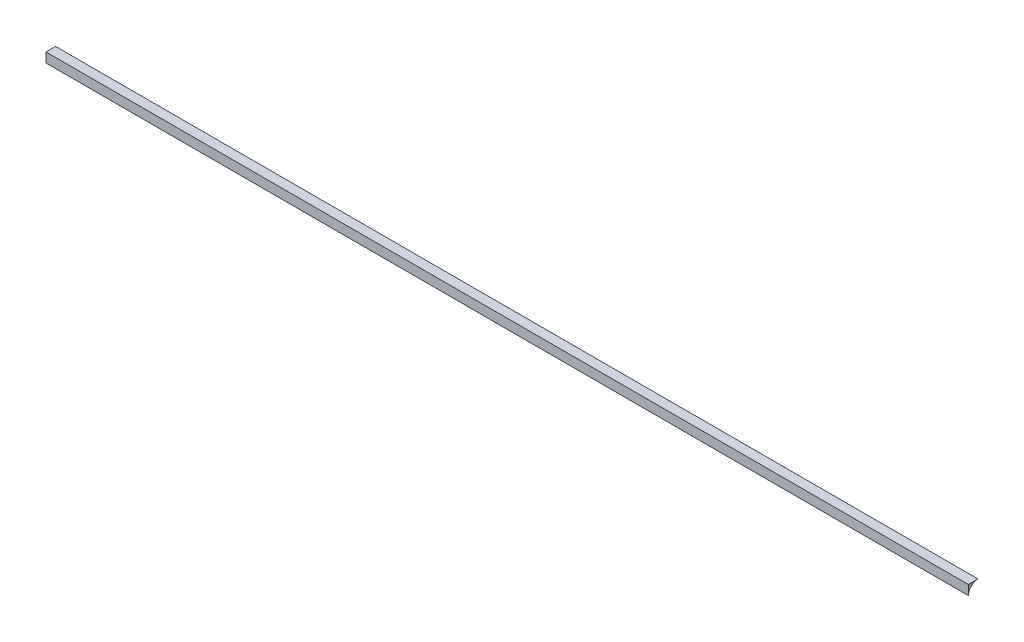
ISO-10303-21;
HEADER;
FILE_DESCRIPTION(('STEP AP214'),'2;1');
FILE_NAME('part.step','',(''),(''),'','','');
FILE_SCHEMA(('AUTOMOTIVE_DESIGN { 1 0 10303 214 1 1 1 1 }'));
ENDSEC;
DATA;
#1=APPLICATION_CONTEXT('core data for automotive mechanical design processes');
#2=APPLICATION_PROTOCOL_DEFINITION('international standard','automotive_design',2000,#1);
#3=PRODUCT_CONTEXT('',#1,'mechanical');
#4=PRODUCT('Part','Part','',(#3));
#5=PRODUCT_RELATED_PRODUCT_CATEGORY('part','',(#4));
#6=PRODUCT_DEFINITION_FORMATION('','',#4);
#7=PRODUCT_DEFINITION_CONTEXT('part definition',#1,'design');
#8=PRODUCT_DEFINITION('design','',#6,#7);
#9=PRODUCT_DEFINITION_SHAPE('','',#8);
#10=(LENGTH_UNIT() NAMED_UNIT(*) SI_UNIT(.MILLI.,.METRE.));
#11=(NAMED_UNIT(*) PLANE_ANGLE_UNIT() SI_UNIT($,.RADIAN.));
#12=(NAMED_UNIT(*) SI_UNIT($,.STERADIAN.) SOLID_ANGLE_UNIT());
#13=UNCERTAINTY_MEASURE_WITH_UNIT(LENGTH_MEASURE(1.E-05),#10,'distance_accuracy_value','');
#14=(GEOMETRIC_REPRESENTATION_CONTEXT(3) GLOBAL_UNCERTAINTY_ASSIGNED_CONTEXT((#13)) GLOBAL_UNIT_ASSIGNED_CONTEXT((#10,
#11,#12)) REPRESENTATION_CONTEXT('',''));
#15=CARTESIAN_POINT('',(0.,0.,0.));
#16=DIRECTION('',(0.,0.,1.));
#17=DIRECTION('',(1.,0.,0.));
#18=AXIS2_PLACEMENT_3D('',#15,#16,#17);
#19=CARTESIAN_POINT('',(304.8,152.4,149.225));
#20=DIRECTION('',(0.,-1.,0.));
#21=DIRECTION('',(0.,0.,-1.));
#22=AXIS2_PLACEMENT_3D('',#19,#20,#21);
#23=PLANE('',#22);
#24=DIRECTION('',(0.,0.,1.));
#25=VECTOR('',#24,1.);
#26=CARTESIAN_POINT('',(0.,152.4,149.225));
#27=LINE('',#26,#25);
#28=CARTESIAN_POINT('',(0.,152.4,149.225));
#29=VERTEX_POINT('',#28);
#30=CARTESIAN_POINT('',(0.,152.4,152.4));
#31=VERTEX_POINT('',#30);
#32=EDGE_CURVE('E160',#29,#31,#27,.T.);
#33=ORIENTED_EDGE('',*,*,#32,.T.);
#34=DIRECTION('',(-1.,0.,0.));
#35=VECTOR('',#34,1.);
#36=CARTESIAN_POINT('',(304.8,152.4,152.4));
#37=LINE('',#36,#35);
#38=CARTESIAN_POINT('',(304.8,152.4,152.4));
#39=VERTEX_POINT('',#38);
#40=EDGE_CURVE('E11',#39,#31,#37,.T.);
#41=ORIENTED_EDGE('',*,*,#40,.F.);
#42=DIRECTION('',(0.,0.,1.));
#43=VECTOR('',#42,1.);
#44=CARTESIAN_POINT('',(304.8,152.4,149.225));
#45=LINE('',#44,#43);
#46=CARTESIAN_POINT('',(304.8,152.4,149.225));
#47=VERTEX_POINT('',#46);
#48=EDGE_CURVE('E184',#47,#39,#45,.T.);
#49=ORIENTED_EDGE('',*,*,#48,.F.);
#50=DIRECTION('',(-1.,0.,0.));
#51=VECTOR('',#50,1.);
#52=CARTESIAN_POINT('',(304.8,152.4,149.225));
#53=LINE('',#52,#51);
#54=EDGE_CURVE('E151',#47,#29,#53,.T.);
#55=ORIENTED_EDGE('',*,*,#54,.T.);
#56=EDGE_LOOP('',(#33,#41,#49,#55));
#57=FACE_BOUND('',#56,.T.);
#58=ADVANCED_FACE('F43',(#57),#23,.F.);
#59=CARTESIAN_POINT('',(304.8,152.4,152.4));
#60=DIRECTION('',(0.,0.,-1.));
#61=DIRECTION('',(-1.,0.,0.));
#62=AXIS2_PLACEMENT_3D('',#59,#60,#61);
#63=PLANE('',#62);
#64=DIRECTION('',(0.,-1.,0.));
#65=VECTOR('',#64,1.);
#66=CARTESIAN_POINT('',(0.,152.4,152.4));
#67=LINE('',#66,#65);
#68=CARTESIAN_POINT('',(0.,149.225,152.4));
#69=VERTEX_POINT('',#68);
#70=EDGE_CURVE('E162',#31,#69,#67,.T.);
#71=ORIENTED_EDGE('',*,*,#70,.T.);
#72=DIRECTION('',(-1.,0.,0.));
#73=VECTOR('',#72,1.);
#74=CARTESIAN_POINT('',(304.8,149.225,152.4));
#75=LINE('',#74,#73);
#76=CARTESIAN_POINT('',(304.8,149.225,152.4));
#77=VERTEX_POINT('',#76);
#78=EDGE_CURVE('E55',#77,#69,#75,.T.);
#79=ORIENTED_EDGE('',*,*,#78,.F.);
#80=DIRECTION('',(0.,-1.,0.));
#81=VECTOR('',#80,1.);
#82=CARTESIAN_POINT('',(304.8,152.4,152.4));
#83=LINE('',#82,#81);
#84=EDGE_CURVE('E107',#39,#77,#83,.T.);
#85=ORIENTED_EDGE('',*,*,#84,.F.);
#86=ORIENTED_EDGE('',*,*,#40,.T.);
#87=EDGE_LOOP('',(#71,#79,#85,#86));
#88=FACE_BOUND('',#87,.T.);
#89=ADVANCED_FACE('F283',(#88),#63,.F.);
#90=CARTESIAN_POINT('',(304.8,149.225,152.4));
#91=DIRECTION('',(0.,0.0980171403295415,0.995184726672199));
#92=DIRECTION('',(0.,-0.995184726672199,0.0980171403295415));
#93=AXIS2_PLACEMENT_3D('',#90,#91,#92);
#94=PLANE('',#93);
#95=DIRECTION('',(0.,0.995184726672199,-0.0980171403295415));
#96=VECTOR('',#95,1.);
#97=CARTESIAN_POINT('',(0.,149.225,152.4));
#98=LINE('',#97,#96);
#99=CARTESIAN_POINT('',(0.,149.844411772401,152.33899326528));
#100=VERTEX_POINT('',#99);
#101=EDGE_CURVE('E161',#69,#100,#98,.T.);
#102=ORIENTED_EDGE('',*,*,#101,.T.);
#103=DIRECTION('',(-1.,0.,0.));
#104=VECTOR('',#103,1.);
#105=CARTESIAN_POINT('',(304.8,149.844411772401,152.33899326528));
#106=LINE('',#105,#104);
#107=CARTESIAN_POINT('',(304.8,149.844411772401,152.33899326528));
#108=VERTEX_POINT('',#107);
#109=EDGE_CURVE('E204',#108,#100,#106,.T.);
#110=ORIENTED_EDGE('',*,*,#109,.F.);
#111=DIRECTION('',(0.,0.995184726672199,-0.0980171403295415));
#112=VECTOR('',#111,1.);
#113=CARTESIAN_POINT('',(304.8,149.225,152.4));
#114=LINE('',#113,#112);
#115=EDGE_CURVE('E214',#77,#108,#114,.T.);
#116=ORIENTED_EDGE('',*,*,#115,.F.);
#117=ORIENTED_EDGE('',*,*,#78,.T.);
#118=EDGE_LOOP('',(#102,#110,#116,#117));
#119=FACE_BOUND('',#118,.T.);
#120=ADVANCED_FACE('F211',(#119),#94,.F.);
#121=CARTESIAN_POINT('',(304.8,149.844411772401,152.33899326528));
#122=DIRECTION('',(0.,0.290284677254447,0.956940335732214));
#123=DIRECTION('',(0.,-0.956940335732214,0.290284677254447));
#124=AXIS2_PLACEMENT_3D('',#121,#122,#123);
#125=PLANE('',#124);
#126=DIRECTION('',(0.,0.956940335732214,-0.290284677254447));
#127=VECTOR('',#126,1.);
#128=CARTESIAN_POINT('',(0.,149.844411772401,152.33899326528));
#129=LINE('',#128,#127);
#130=CARTESIAN_POINT('',(0.,150.440019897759,152.158317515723));
#131=VERTEX_POINT('',#130);
#132=EDGE_CURVE('E167',#100,#131,#129,.T.);
#133=ORIENTED_EDGE('',*,*,#132,.T.);
#134=DIRECTION('',(-1.,0.,0.));
#135=VECTOR('',#134,1.);
#136=CARTESIAN_POINT('',(304.8,150.440019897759,152.158317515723));
#137=LINE('',#136,#135);
#138=CARTESIAN_POINT('',(304.8,150.440019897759,152.158317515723));
#139=VERTEX_POINT('',#138);
#140=EDGE_CURVE('E199',#139,#131,#137,.T.);
#141=ORIENTED_EDGE('',*,*,#140,.F.);
#142=DIRECTION('',(0.,0.956940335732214,-0.290284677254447));
#143=VECTOR('',#142,1.);
#144=CARTESIAN_POINT('',(304.8,149.844411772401,152.33899326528));
#145=LINE('',#144,#143);
#146=EDGE_CURVE('E233',#108,#139,#145,.T.);
#147=ORIENTED_EDGE('',*,*,#146,.F.);
#148=ORIENTED_EDGE('',*,*,#109,.T.);
#149=EDGE_LOOP('',(#133,#141,#147,#148));
#150=FACE_BOUND('',#149,.T.);
#151=ADVANCED_FACE('F222',(#150),#125,.F.);
#152=CARTESIAN_POINT('',(304.8,150.440019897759,152.158317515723));
#153=DIRECTION('',(0.,0.47139673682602,0.881921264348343));
#154=DIRECTION('',(0.,-0.881921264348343,0.47139673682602));
#155=AXIS2_PLACEMENT_3D('',#152,#153,#154);
#156=PLANE('',#155);
#157=DIRECTION('',(0.,0.881921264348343,-0.47139673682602));
#158=VECTOR('',#157,1.);
#159=CARTESIAN_POINT('',(0.,150.440019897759,152.158317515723));
#160=LINE('',#159,#158);
#161=CARTESIAN_POINT('',(0.,150.988935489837,151.864916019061));
#162=VERTEX_POINT('',#161);
#163=EDGE_CURVE('E169',#131,#162,#160,.T.);
#164=ORIENTED_EDGE('',*,*,#163,.T.);
#165=DIRECTION('',(-1.,0.,0.));
#166=VECTOR('',#165,1.);
#167=CARTESIAN_POINT('',(304.8,150.988935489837,151.864916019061));
#168=LINE('',#167,#166);
#169=CARTESIAN_POINT('',(304.8,150.988935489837,151.864916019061));
#170=VERTEX_POINT('',#169);
#171=EDGE_CURVE('E198',#170,#162,#168,.T.);
#172=ORIENTED_EDGE('',*,*,#171,.F.);
#173=DIRECTION('',(0.,0.881921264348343,-0.47139673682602));
#174=VECTOR('',#173,1.);
#175=CARTESIAN_POINT('',(304.8,150.440019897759,152.158317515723));
#176=LINE('',#175,#174);
#177=EDGE_CURVE('E229',#139,#170,#176,.T.);
#178=ORIENTED_EDGE('',*,*,#177,.F.);
#179=ORIENTED_EDGE('',*,*,#140,.T.);
#180=EDGE_LOOP('',(#164,#172,#178,#179));
#181=FACE_BOUND('',#180,.T.);
#182=ADVANCED_FACE('F228',(#181),#156,.F.);
#183=CARTESIAN_POINT('',(304.8,150.988935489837,151.864916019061));
#184=DIRECTION('',(0.,0.634393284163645,0.773010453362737));
#185=DIRECTION('',(0.,-0.773010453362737,0.634393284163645));
#186=AXIS2_PLACEMENT_3D('',#183,#184,#185);
#187=PLANE('',#186);
#188=DIRECTION('',(0.,0.773010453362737,-0.634393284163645));
#189=VECTOR('',#188,1.);
#190=CARTESIAN_POINT('',(0.,150.988935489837,151.864916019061));
#191=LINE('',#190,#189);
#192=CARTESIAN_POINT('',(0.,151.470064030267,151.470064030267));
#193=VERTEX_POINT('',#192);
#194=EDGE_CURVE('E171',#162,#193,#191,.T.);
#195=ORIENTED_EDGE('',*,*,#194,.T.);
#196=DIRECTION('',(-1.,0.,0.));
#197=VECTOR('',#196,1.);
#198=CARTESIAN_POINT('',(304.8,151.470064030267,151.470064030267));
#199=LINE('',#198,#197);
#200=CARTESIAN_POINT('',(304.8,151.470064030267,151.470064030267));
#201=VERTEX_POINT('',#200);
#202=EDGE_CURVE('E195',#201,#193,#199,.T.);
#203=ORIENTED_EDGE('',*,*,#202,.F.);
#204=DIRECTION('',(0.,0.773010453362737,-0.634393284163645));
#205=VECTOR('',#204,1.);
#206=CARTESIAN_POINT('',(304.8,150.988935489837,151.864916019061));
#207=LINE('',#206,#205);
#208=EDGE_CURVE('E232',#170,#201,#207,.T.);
#209=ORIENTED_EDGE('',*,*,#208,.F.);
#210=ORIENTED_EDGE('',*,*,#171,.T.);
#211=EDGE_LOOP('',(#195,#203,#209,#210));
#212=FACE_BOUND('',#211,.T.);
#213=ADVANCED_FACE('F300',(#212),#187,.F.);
#214=CARTESIAN_POINT('',(304.8,151.470064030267,151.470064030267));
#215=DIRECTION('',(0.,0.773010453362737,0.634393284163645));
#216=DIRECTION('',(0.,-0.634393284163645,0.773010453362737));
#217=AXIS2_PLACEMENT_3D('',#214,#215,#216);
#218=PLANE('',#217);
#219=DIRECTION('',(0.,0.634393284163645,-0.773010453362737));
#220=VECTOR('',#219,1.);
#221=CARTESIAN_POINT('',(0.,151.470064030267,151.470064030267));
#222=LINE('',#221,#220);
#223=CARTESIAN_POINT('',(0.,151.864916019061,150.988935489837));
#224=VERTEX_POINT('',#223);
#225=EDGE_CURVE('E176',#193,#224,#222,.T.);
#226=ORIENTED_EDGE('',*,*,#225,.T.);
#227=DIRECTION('',(-1.,0.,0.));
#228=VECTOR('',#227,1.);
#229=CARTESIAN_POINT('',(304.8,151.864916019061,150.988935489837));
#230=LINE('',#229,#228);
#231=CARTESIAN_POINT('',(304.8,151.864916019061,150.988935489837));
#232=VERTEX_POINT('',#231);
#233=EDGE_CURVE('E144',#232,#224,#230,.T.);
#234=ORIENTED_EDGE('',*,*,#233,.F.);
#235=DIRECTION('',(0.,0.634393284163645,-0.773010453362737));
#236=VECTOR('',#235,1.);
#237=CARTESIAN_POINT('',(304.8,151.470064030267,151.470064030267));
#238=LINE('',#237,#236);
#239=EDGE_CURVE('E132',#201,#232,#238,.T.);
#240=ORIENTED_EDGE('',*,*,#239,.F.);
#241=ORIENTED_EDGE('',*,*,#202,.T.);
#242=EDGE_LOOP('',(#226,#234,#240,#241));
#243=FACE_BOUND('',#242,.T.);
#244=ADVANCED_FACE('F303',(#243),#218,.F.);
#245=CARTESIAN_POINT('',(304.8,151.864916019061,150.988935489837));
#246=DIRECTION('',(0.,0.881921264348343,0.47139673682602));
#247=DIRECTION('',(0.,-0.47139673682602,0.881921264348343));
#248=AXIS2_PLACEMENT_3D('',#245,#246,#247);
#249=PLANE('',#248);
#250=DIRECTION('',(0.,0.47139673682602,-0.881921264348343));
#251=VECTOR('',#250,1.);
#252=CARTESIAN_POINT('',(0.,151.864916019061,150.988935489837));
#253=LINE('',#252,#251);
#254=CARTESIAN_POINT('',(0.,152.158317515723,150.440019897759));
#255=VERTEX_POINT('',#254);
#256=EDGE_CURVE('E142',#224,#255,#253,.T.);
#257=ORIENTED_EDGE('',*,*,#256,.T.);
#258=DIRECTION('',(-1.,0.,0.));
#259=VECTOR('',#258,1.);
#260=CARTESIAN_POINT('',(304.8,152.158317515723,150.440019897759));
#261=LINE('',#260,#259);
#262=CARTESIAN_POINT('',(304.8,152.158317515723,150.440019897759));
#263=VERTEX_POINT('',#262);
#264=EDGE_CURVE('E139',#263,#255,#261,.T.);
#265=ORIENTED_EDGE('',*,*,#264,.F.);
#266=DIRECTION('',(0.,0.47139673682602,-0.881921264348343));
#267=VECTOR('',#266,1.);
#268=CARTESIAN_POINT('',(304.8,151.864916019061,150.988935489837));
#269=LINE('',#268,#267);
#270=EDGE_CURVE('E126',#232,#263,#269,.T.);
#271=ORIENTED_EDGE('',*,*,#270,.F.);
#272=ORIENTED_EDGE('',*,*,#233,.T.);
#273=EDGE_LOOP('',(#257,#265,#271,#272));
#274=FACE_BOUND('',#273,.T.);
#275=ADVANCED_FACE('F141',(#274),#249,.F.);
#276=CARTESIAN_POINT('',(304.8,152.158317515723,150.440019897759));
#277=DIRECTION('',(0.,0.956940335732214,0.290284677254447));
#278=DIRECTION('',(0.,-0.290284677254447,0.956940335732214));
#279=AXIS2_PLACEMENT_3D('',#276,#277,#278);
#280=PLANE('',#279);
#281=DIRECTION('',(0.,0.290284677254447,-0.956940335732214));
#282=VECTOR('',#281,1.);
#283=CARTESIAN_POINT('',(0.,152.158317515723,150.440019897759));
#284=LINE('',#283,#282);
#285=CARTESIAN_POINT('',(0.,152.33899326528,149.844411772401));
#286=VERTEX_POINT('',#285);
#287=EDGE_CURVE('E94',#255,#286,#284,.T.);
#288=ORIENTED_EDGE('',*,*,#287,.T.);
#289=DIRECTION('',(-1.,0.,0.));
#290=VECTOR('',#289,1.);
#291=CARTESIAN_POINT('',(304.8,152.33899326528,149.844411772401));
#292=LINE('',#291,#290);
#293=CARTESIAN_POINT('',(304.8,152.33899326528,149.844411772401));
#294=VERTEX_POINT('',#293);
#295=EDGE_CURVE('E147',#294,#286,#292,.T.);
#296=ORIENTED_EDGE('',*,*,#295,.F.);
#297=DIRECTION('',(0.,0.290284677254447,-0.956940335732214));
#298=VECTOR('',#297,1.);
#299=CARTESIAN_POINT('',(304.8,152.158317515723,150.440019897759));
#300=LINE('',#299,#298);
#301=EDGE_CURVE('E135',#263,#294,#300,.T.);
#302=ORIENTED_EDGE('',*,*,#301,.F.);
#303=ORIENTED_EDGE('',*,*,#264,.T.);
#304=EDGE_LOOP('',(#288,#296,#302,#303));
#305=FACE_BOUND('',#304,.T.);
#306=ADVANCED_FACE('F149',(#305),#280,.F.);
#307=CARTESIAN_POINT('',(304.8,152.33899326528,149.844411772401));
#308=DIRECTION('',(0.,0.995184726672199,0.0980171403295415));
#309=DIRECTION('',(0.,-0.0980171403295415,0.995184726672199));
#310=AXIS2_PLACEMENT_3D('',#307,#308,#309);
#311=PLANE('',#310);
#312=DIRECTION('',(0.,0.0980171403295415,-0.995184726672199));
#313=VECTOR('',#312,1.);
#314=CARTESIAN_POINT('',(0.,152.33899326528,149.844411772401));
#315=LINE('',#314,#313);
#316=EDGE_CURVE('E102',#286,#29,#315,.T.);
#317=ORIENTED_EDGE('',*,*,#316,.T.);
#318=ORIENTED_EDGE('',*,*,#54,.F.);
#319=DIRECTION('',(0.,0.0980171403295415,-0.995184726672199));
#320=VECTOR('',#319,1.);
#321=CARTESIAN_POINT('',(304.8,152.33899326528,149.844411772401));
#322=LINE('',#321,#320);
#323=EDGE_CURVE('E58',#294,#47,#322,.T.);
#324=ORIENTED_EDGE('',*,*,#323,.F.);
#325=ORIENTED_EDGE('',*,*,#295,.T.);
#326=EDGE_LOOP('',(#317,#318,#324,#325));
#327=FACE_BOUND('',#326,.T.);
#328=ADVANCED_FACE('F307',(#327),#311,.F.);
#329=CARTESIAN_POINT('',(304.8,0.,0.));
#330=DIRECTION('',(1.,0.,0.));
#331=DIRECTION('',(0.,0.,-1.));
#332=AXIS2_PLACEMENT_3D('',#329,#330,#331);
#333=PLANE('',#332);
#334=ORIENTED_EDGE('',*,*,#48,.T.);
#335=ORIENTED_EDGE('',*,*,#84,.T.);
#336=ORIENTED_EDGE('',*,*,#115,.T.);
#337=ORIENTED_EDGE('',*,*,#146,.T.);
#338=ORIENTED_EDGE('',*,*,#177,.T.);
#339=ORIENTED_EDGE('',*,*,#208,.T.);
#340=ORIENTED_EDGE('',*,*,#239,.T.);
#341=ORIENTED_EDGE('',*,*,#270,.T.);
#342=ORIENTED_EDGE('',*,*,#301,.T.);
#343=ORIENTED_EDGE('',*,*,#323,.T.);
#344=EDGE_LOOP('',(#334,#335,#336,#337,#338,#339,#340,#341,#342,#343));
#345=FACE_BOUND('',#344,.T.);
#346=ADVANCED_FACE('F127',(#345),#333,.T.);
#347=CARTESIAN_POINT('',(0.,0.,0.));
#348=DIRECTION('',(1.,0.,0.));
#349=DIRECTION('',(0.,0.,-1.));
#350=AXIS2_PLACEMENT_3D('',#347,#348,#349);
#351=PLANE('',#350);
#352=ORIENTED_EDGE('',*,*,#32,.F.);
#353=ORIENTED_EDGE('',*,*,#316,.F.);
#354=ORIENTED_EDGE('',*,*,#287,.F.);
#355=ORIENTED_EDGE('',*,*,#256,.F.);
#356=ORIENTED_EDGE('',*,*,#225,.F.);
#357=ORIENTED_EDGE('',*,*,#194,.F.);
#358=ORIENTED_EDGE('',*,*,#163,.F.);
#359=ORIENTED_EDGE('',*,*,#132,.F.);
#360=ORIENTED_EDGE('',*,*,#101,.F.);
#361=ORIENTED_EDGE('',*,*,#70,.F.);
#362=EDGE_LOOP('',(#352,#353,#354,#355,#356,#357,#358,#359,#360,#361));
#363=FACE_BOUND('',#362,.T.);
#364=ADVANCED_FACE('F219',(#363),#351,.F.);
#365=CLOSED_SHELL('',(#58,#89,#120,#151,#182,#213,#244,#275,#306,#328,#346,#364));
#366=MANIFOLD_SOLID_BREP('B2',#365);
#367=ADVANCED_BREP_SHAPE_REPRESENTATION('',(#18,#366),#14);
#368=SHAPE_DEFINITION_REPRESENTATION(#9,#367);
ENDSEC;
END-ISO-10303-21;
